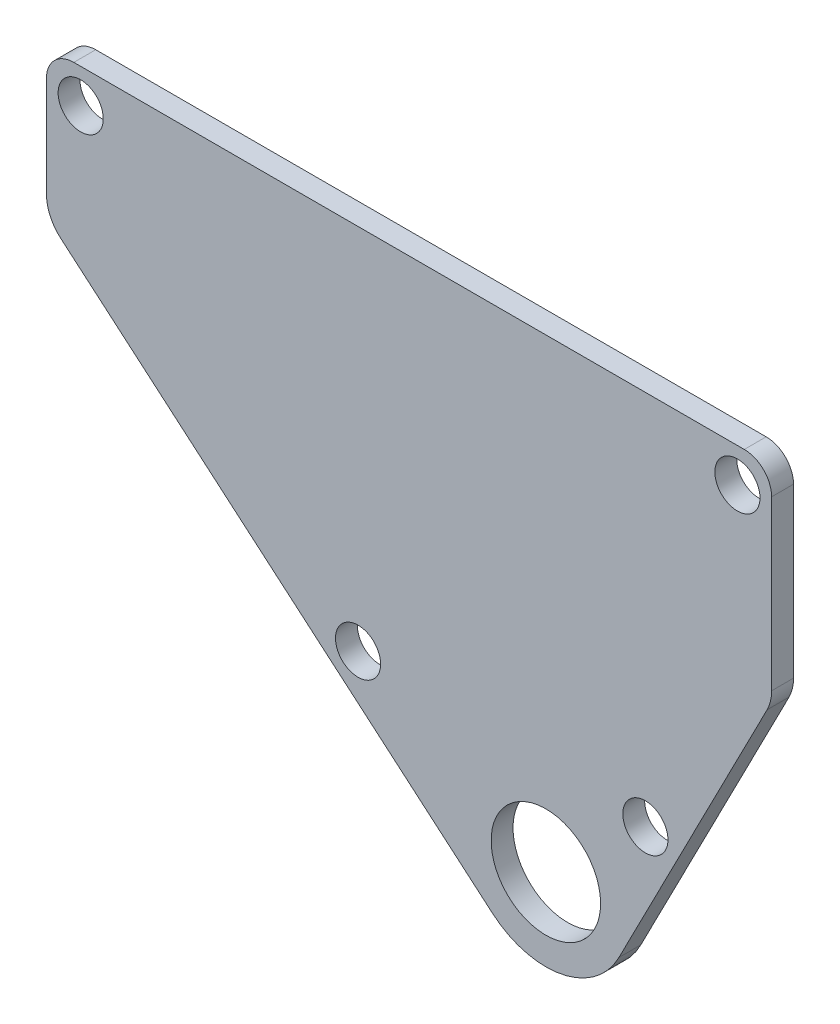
ISO-10303-21;
HEADER;
FILE_DESCRIPTION(('STEP AP214'),'2;1');
FILE_NAME('part.step','',(''),(''),'','','');
FILE_SCHEMA(('AUTOMOTIVE_DESIGN { 1 0 10303 214 1 1 1 1 }'));
ENDSEC;
DATA;
#1=APPLICATION_CONTEXT('core data for automotive mechanical design processes');
#2=APPLICATION_PROTOCOL_DEFINITION('international standard','automotive_design',2000,#1);
#3=PRODUCT_CONTEXT('',#1,'mechanical');
#4=PRODUCT('Part','Part','',(#3));
#5=PRODUCT_RELATED_PRODUCT_CATEGORY('part','',(#4));
#6=PRODUCT_DEFINITION_FORMATION('','',#4);
#7=PRODUCT_DEFINITION_CONTEXT('part definition',#1,'design');
#8=PRODUCT_DEFINITION('design','',#6,#7);
#9=PRODUCT_DEFINITION_SHAPE('','',#8);
#10=(LENGTH_UNIT() NAMED_UNIT(*) SI_UNIT(.MILLI.,.METRE.));
#11=(NAMED_UNIT(*) PLANE_ANGLE_UNIT() SI_UNIT($,.RADIAN.));
#12=(NAMED_UNIT(*) SI_UNIT($,.STERADIAN.) SOLID_ANGLE_UNIT());
#13=UNCERTAINTY_MEASURE_WITH_UNIT(LENGTH_MEASURE(1.E-05),#10,'distance_accuracy_value','');
#14=(GEOMETRIC_REPRESENTATION_CONTEXT(3) GLOBAL_UNCERTAINTY_ASSIGNED_CONTEXT((#13)) GLOBAL_UNIT_ASSIGNED_CONTEXT((#10,
#11,#12)) REPRESENTATION_CONTEXT('',''));
#15=CARTESIAN_POINT('',(0.,0.,0.));
#16=DIRECTION('',(0.,0.,1.));
#17=DIRECTION('',(1.,0.,0.));
#18=AXIS2_PLACEMENT_3D('',#15,#16,#17);
#19=CARTESIAN_POINT('',(-40.,-40.,1.6));
#20=DIRECTION('',(0.,0.,-1.));
#21=DIRECTION('',(-1.,0.,0.));
#22=AXIS2_PLACEMENT_3D('',#19,#20,#21);
#23=PLANE('',#22);
#24=CARTESIAN_POINT('',(23.4995807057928,5.99918336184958,1.6));
#25=DIRECTION('',(0.,0.,1.));
#26=DIRECTION('',(1.,0.,0.));
#27=AXIS2_PLACEMENT_3D('',#24,#25,#26);
#28=CIRCLE('',#27,6.);
#29=CARTESIAN_POINT('',(28.8371435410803,3.25866826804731,1.6));
#30=VERTEX_POINT('',#29);
#31=CARTESIAN_POINT('',(19.6038678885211,1.43591461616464,1.6));
#32=VERTEX_POINT('',#31);
#33=EDGE_CURVE('E103',#30,#32,#28,.F.);
#34=ORIENTED_EDGE('',*,*,#33,.F.);
#35=DIRECTION('',(0.456752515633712,0.889593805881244,0.));
#36=VECTOR('',#35,1.);
#37=CARTESIAN_POINT('',(40.,25.,1.6));
#38=LINE('',#37,#36);
#39=CARTESIAN_POINT('',(39.6687814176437,24.3549022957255,1.6));
#40=VERTEX_POINT('',#39);
#41=EDGE_CURVE('E100',#40,#30,#38,.F.);
#42=ORIENTED_EDGE('',*,*,#41,.F.);
#43=CARTESIAN_POINT('',(37.,25.7251598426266,1.6));
#44=DIRECTION('',(0.,0.,-1.));
#45=DIRECTION('',(-1.,0.,0.));
#46=AXIS2_PLACEMENT_3D('',#43,#44,#45);
#47=CIRCLE('',#46,3.);
#48=CARTESIAN_POINT('',(40.,25.7251598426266,1.6));
#49=VERTEX_POINT('',#48);
#50=EDGE_CURVE('E20',#49,#40,#47,.T.);
#51=ORIENTED_EDGE('',*,*,#50,.F.);
#52=DIRECTION('',(0.,-1.,0.));
#53=VECTOR('',#52,1.);
#54=CARTESIAN_POINT('',(40.,40.,1.6));
#55=LINE('',#54,#53);
#56=CARTESIAN_POINT('',(40.,38.,1.6));
#57=VERTEX_POINT('',#56);
#58=EDGE_CURVE('E117',#49,#57,#55,.F.);
#59=ORIENTED_EDGE('',*,*,#58,.T.);
#60=CARTESIAN_POINT('',(38.,38.,1.6));
#61=DIRECTION('',(0.,0.,-1.));
#62=DIRECTION('',(-1.,0.,0.));
#63=AXIS2_PLACEMENT_3D('',#60,#61,#62);
#64=CIRCLE('',#63,2.);
#65=CARTESIAN_POINT('',(38.,40.,1.6));
#66=VERTEX_POINT('',#65);
#67=EDGE_CURVE('E127',#66,#57,#64,.T.);
#68=ORIENTED_EDGE('',*,*,#67,.F.);
#69=DIRECTION('',(1.,0.,0.));
#70=VECTOR('',#69,1.);
#71=CARTESIAN_POINT('',(40.,40.,1.6));
#72=LINE('',#71,#70);
#73=CARTESIAN_POINT('',(-11.,40.,1.6));
#74=VERTEX_POINT('',#73);
#75=EDGE_CURVE('E130',#66,#74,#72,.F.);
#76=ORIENTED_EDGE('',*,*,#75,.T.);
#77=CARTESIAN_POINT('',(-11.,38.,1.6));
#78=DIRECTION('',(0.,0.,-1.));
#79=DIRECTION('',(-1.,0.,0.));
#80=AXIS2_PLACEMENT_3D('',#77,#78,#79);
#81=CIRCLE('',#80,2.);
#82=CARTESIAN_POINT('',(-13.,38.,1.6));
#83=VERTEX_POINT('',#82);
#84=EDGE_CURVE('E131',#83,#74,#81,.T.);
#85=ORIENTED_EDGE('',*,*,#84,.F.);
#86=DIRECTION('',(0.,1.,0.));
#87=VECTOR('',#86,1.);
#88=CARTESIAN_POINT('',(-13.,40.,1.6));
#89=LINE('',#88,#87);
#90=CARTESIAN_POINT('',(-13.,30.6536037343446,1.6));
#91=VERTEX_POINT('',#90);
#92=EDGE_CURVE('E135',#91,#83,#89,.T.);
#93=ORIENTED_EDGE('',*,*,#92,.F.);
#94=CARTESIAN_POINT('',(-10.,30.6536037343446,1.6));
#95=DIRECTION('',(0.,0.,1.));
#96=DIRECTION('',(1.,0.,0.));
#97=AXIS2_PLACEMENT_3D('',#94,#95,#96);
#98=CIRCLE('',#97,3.);
#99=CARTESIAN_POINT('',(-11.9478564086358,28.3719693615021,1.6));
#100=VERTEX_POINT('',#99);
#101=EDGE_CURVE('E139',#100,#91,#98,.F.);
#102=ORIENTED_EDGE('',*,*,#101,.F.);
#103=DIRECTION('',(0.760544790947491,-0.649285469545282,0.));
#104=VECTOR('',#103,1.);
#105=CARTESIAN_POINT('',(8.9735043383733,10.5111731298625,1.6));
#106=LINE('',#105,#104);
#107=EDGE_CURVE('E143',#32,#100,#106,.F.);
#108=ORIENTED_EDGE('',*,*,#107,.F.);
#109=EDGE_LOOP('',(#34,#42,#51,#59,#68,#76,#85,#93,#102,#108));
#110=FACE_BOUND('',#109,.T.);
#111=CARTESIAN_POINT('',(23.5,6.,1.6));
#112=DIRECTION('',(0.,0.,1.));
#113=DIRECTION('',(1.,0.,0.));
#114=AXIS2_PLACEMENT_3D('',#111,#112,#113);
#115=CIRCLE('',#114,4.);
#116=CARTESIAN_POINT('',(27.5,6.,1.6));
#117=VERTEX_POINT('',#116);
#118=EDGE_CURVE('E107',#117,#117,#115,.F.);
#119=ORIENTED_EDGE('',*,*,#118,.T.);
#120=EDGE_LOOP('',(#119));
#121=FACE_BOUND('',#120,.T.);
#122=CARTESIAN_POINT('',(-10.5000008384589,37.5000001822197,1.6));
#123=DIRECTION('',(0.,0.,1.));
#124=DIRECTION('',(1.,0.,0.));
#125=AXIS2_PLACEMENT_3D('',#122,#123,#124);
#126=CIRCLE('',#125,1.65);
#127=CARTESIAN_POINT('',(-8.85000083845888,37.5000001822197,1.6));
#128=VERTEX_POINT('',#127);
#129=EDGE_CURVE('E185',#128,#128,#126,.F.);
#130=ORIENTED_EDGE('',*,*,#129,.T.);
#131=EDGE_LOOP('',(#130));
#132=FACE_BOUND('',#131,.T.);
#133=CARTESIAN_POINT('',(37.5000281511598,37.4999997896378,1.6));
#134=DIRECTION('',(0.,0.,1.));
#135=DIRECTION('',(1.,0.,0.));
#136=AXIS2_PLACEMENT_3D('',#133,#134,#135);
#137=CIRCLE('',#136,1.64999999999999);
#138=CARTESIAN_POINT('',(39.1500281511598,37.4999997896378,1.6));
#139=VERTEX_POINT('',#138);
#140=EDGE_CURVE('E188',#139,#139,#137,.F.);
#141=ORIENTED_EDGE('',*,*,#140,.T.);
#142=EDGE_LOOP('',(#141));
#143=FACE_BOUND('',#142,.T.);
#144=CARTESIAN_POINT('',(30.77175874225,12.499986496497,1.6));
#145=DIRECTION('',(0.,0.,1.));
#146=DIRECTION('',(1.,0.,0.));
#147=AXIS2_PLACEMENT_3D('',#144,#145,#146);
#148=CIRCLE('',#147,1.65);
#149=CARTESIAN_POINT('',(32.42175874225,12.499986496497,1.6));
#150=VERTEX_POINT('',#149);
#151=EDGE_CURVE('E191',#150,#150,#148,.F.);
#152=ORIENTED_EDGE('',*,*,#151,.T.);
#153=EDGE_LOOP('',(#152));
#154=FACE_BOUND('',#153,.T.);
#155=CARTESIAN_POINT('',(9.77175874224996,13.1168119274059,1.6));
#156=DIRECTION('',(0.,0.,1.));
#157=DIRECTION('',(1.,0.,0.));
#158=AXIS2_PLACEMENT_3D('',#155,#156,#157);
#159=CIRCLE('',#158,1.65);
#160=CARTESIAN_POINT('',(11.42175874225,13.1168119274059,1.6));
#161=VERTEX_POINT('',#160);
#162=EDGE_CURVE('E98',#161,#161,#159,.F.);
#163=ORIENTED_EDGE('',*,*,#162,.T.);
#164=EDGE_LOOP('',(#163));
#165=FACE_BOUND('',#164,.T.);
#166=ADVANCED_FACE('F17',(#110,#121,#132,#143,#154,#165),#23,.F.);
#167=CARTESIAN_POINT('',(9.77175874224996,13.1168119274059,0.));
#168=DIRECTION('',(0.,0.,1.));
#169=DIRECTION('',(1.,0.,0.));
#170=AXIS2_PLACEMENT_3D('',#167,#168,#169);
#171=CYLINDRICAL_SURFACE('',#170,1.65);
#172=ORIENTED_EDGE('',*,*,#162,.F.);
#173=EDGE_LOOP('',(#172));
#174=FACE_BOUND('',#173,.T.);
#175=CARTESIAN_POINT('',(9.77175874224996,13.1168119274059,0.));
#176=DIRECTION('',(0.,0.,1.));
#177=DIRECTION('',(1.,0.,0.));
#178=AXIS2_PLACEMENT_3D('',#175,#176,#177);
#179=CIRCLE('',#178,1.65);
#180=CARTESIAN_POINT('',(11.42175874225,13.1168119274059,0.));
#181=VERTEX_POINT('',#180);
#182=EDGE_CURVE('E112',#181,#181,#179,.T.);
#183=ORIENTED_EDGE('',*,*,#182,.F.);
#184=EDGE_LOOP('',(#183));
#185=FACE_BOUND('',#184,.T.);
#186=ADVANCED_FACE('F197',(#174,#185),#171,.F.);
#187=CARTESIAN_POINT('',(30.77175874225,12.499986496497,0.));
#188=DIRECTION('',(0.,0.,1.));
#189=DIRECTION('',(1.,0.,0.));
#190=AXIS2_PLACEMENT_3D('',#187,#188,#189);
#191=CYLINDRICAL_SURFACE('',#190,1.65);
#192=ORIENTED_EDGE('',*,*,#151,.F.);
#193=EDGE_LOOP('',(#192));
#194=FACE_BOUND('',#193,.T.);
#195=CARTESIAN_POINT('',(30.77175874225,12.499986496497,0.));
#196=DIRECTION('',(0.,0.,1.));
#197=DIRECTION('',(1.,0.,0.));
#198=AXIS2_PLACEMENT_3D('',#195,#196,#197);
#199=CIRCLE('',#198,1.65);
#200=CARTESIAN_POINT('',(32.42175874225,12.499986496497,0.));
#201=VERTEX_POINT('',#200);
#202=EDGE_CURVE('E115',#201,#201,#199,.T.);
#203=ORIENTED_EDGE('',*,*,#202,.F.);
#204=EDGE_LOOP('',(#203));
#205=FACE_BOUND('',#204,.T.);
#206=ADVANCED_FACE('F200',(#194,#205),#191,.F.);
#207=CARTESIAN_POINT('',(37.5000281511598,37.4999997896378,0.));
#208=DIRECTION('',(0.,0.,1.));
#209=DIRECTION('',(1.,0.,0.));
#210=AXIS2_PLACEMENT_3D('',#207,#208,#209);
#211=CYLINDRICAL_SURFACE('',#210,1.64999999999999);
#212=ORIENTED_EDGE('',*,*,#140,.F.);
#213=EDGE_LOOP('',(#212));
#214=FACE_BOUND('',#213,.T.);
#215=CARTESIAN_POINT('',(37.5000281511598,37.4999997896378,0.));
#216=DIRECTION('',(0.,0.,1.));
#217=DIRECTION('',(1.,0.,0.));
#218=AXIS2_PLACEMENT_3D('',#215,#216,#217);
#219=CIRCLE('',#218,1.64999999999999);
#220=CARTESIAN_POINT('',(39.1500281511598,37.4999997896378,0.));
#221=VERTEX_POINT('',#220);
#222=EDGE_CURVE('E174',#221,#221,#219,.T.);
#223=ORIENTED_EDGE('',*,*,#222,.F.);
#224=EDGE_LOOP('',(#223));
#225=FACE_BOUND('',#224,.T.);
#226=ADVANCED_FACE('F255',(#214,#225),#211,.F.);
#227=CARTESIAN_POINT('',(-10.5000008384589,37.5000001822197,0.));
#228=DIRECTION('',(0.,0.,1.));
#229=DIRECTION('',(1.,0.,0.));
#230=AXIS2_PLACEMENT_3D('',#227,#228,#229);
#231=CYLINDRICAL_SURFACE('',#230,1.65);
#232=ORIENTED_EDGE('',*,*,#129,.F.);
#233=EDGE_LOOP('',(#232));
#234=FACE_BOUND('',#233,.T.);
#235=CARTESIAN_POINT('',(-10.5000008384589,37.5000001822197,0.));
#236=DIRECTION('',(0.,0.,1.));
#237=DIRECTION('',(1.,0.,0.));
#238=AXIS2_PLACEMENT_3D('',#235,#236,#237);
#239=CIRCLE('',#238,1.65);
#240=CARTESIAN_POINT('',(-8.85000083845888,37.5000001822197,0.));
#241=VERTEX_POINT('',#240);
#242=EDGE_CURVE('E171',#241,#241,#239,.T.);
#243=ORIENTED_EDGE('',*,*,#242,.F.);
#244=EDGE_LOOP('',(#243));
#245=FACE_BOUND('',#244,.T.);
#246=ADVANCED_FACE('F251',(#234,#245),#231,.F.);
#247=CARTESIAN_POINT('',(23.5,6.,0.));
#248=DIRECTION('',(0.,0.,1.));
#249=DIRECTION('',(1.,0.,0.));
#250=AXIS2_PLACEMENT_3D('',#247,#248,#249);
#251=CYLINDRICAL_SURFACE('',#250,4.);
#252=ORIENTED_EDGE('',*,*,#118,.F.);
#253=EDGE_LOOP('',(#252));
#254=FACE_BOUND('',#253,.T.);
#255=CARTESIAN_POINT('',(23.5,6.,0.));
#256=DIRECTION('',(0.,0.,1.));
#257=DIRECTION('',(1.,0.,0.));
#258=AXIS2_PLACEMENT_3D('',#255,#256,#257);
#259=CIRCLE('',#258,4.);
#260=CARTESIAN_POINT('',(27.5,6.,0.));
#261=VERTEX_POINT('',#260);
#262=EDGE_CURVE('E168',#261,#261,#259,.T.);
#263=ORIENTED_EDGE('',*,*,#262,.F.);
#264=EDGE_LOOP('',(#263));
#265=FACE_BOUND('',#264,.T.);
#266=ADVANCED_FACE('F248',(#254,#265),#251,.F.);
#267=CARTESIAN_POINT('',(40.,25.,0.));
#268=DIRECTION('',(0.889593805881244,-0.456752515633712,0.));
#269=DIRECTION('',(0.456752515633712,0.889593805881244,0.));
#270=AXIS2_PLACEMENT_3D('',#267,#268,#269);
#271=PLANE('',#270);
#272=DIRECTION('',(-0.456752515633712,-0.889593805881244,0.));
#273=VECTOR('',#272,1.);
#274=CARTESIAN_POINT('',(39.6687814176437,24.3549022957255,0.));
#275=LINE('',#274,#273);
#276=CARTESIAN_POINT('',(39.6687814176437,24.3549022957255,0.));
#277=VERTEX_POINT('',#276);
#278=CARTESIAN_POINT('',(28.8371435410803,3.25866826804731,0.));
#279=VERTEX_POINT('',#278);
#280=EDGE_CURVE('E111',#277,#279,#275,.T.);
#281=ORIENTED_EDGE('',*,*,#280,.F.);
#282=DIRECTION('',(0.,0.,-1.));
#283=VECTOR('',#282,1.);
#284=CARTESIAN_POINT('',(39.6687814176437,24.3549022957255,0.));
#285=LINE('',#284,#283);
#286=EDGE_CURVE('E97',#40,#277,#285,.T.);
#287=ORIENTED_EDGE('',*,*,#286,.F.);
#288=ORIENTED_EDGE('',*,*,#41,.T.);
#289=DIRECTION('',(0.,0.,1.));
#290=VECTOR('',#289,1.);
#291=CARTESIAN_POINT('',(28.8371435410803,3.25866826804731,-8.4));
#292=LINE('',#291,#290);
#293=EDGE_CURVE('E106',#279,#30,#292,.T.);
#294=ORIENTED_EDGE('',*,*,#293,.F.);
#295=EDGE_LOOP('',(#281,#287,#288,#294));
#296=FACE_BOUND('',#295,.T.);
#297=ADVANCED_FACE('F109',(#296),#271,.T.);
#298=CARTESIAN_POINT('',(23.4995807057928,5.99918336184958,-8.4));
#299=DIRECTION('',(0.,0.,1.));
#300=DIRECTION('',(1.,0.,0.));
#301=AXIS2_PLACEMENT_3D('',#298,#299,#300);
#302=CYLINDRICAL_SURFACE('',#301,6.);
#303=ORIENTED_EDGE('',*,*,#33,.T.);
#304=DIRECTION('',(0.,0.,1.));
#305=VECTOR('',#304,1.);
#306=CARTESIAN_POINT('',(19.6038678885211,1.43591461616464,-8.4));
#307=LINE('',#306,#305);
#308=CARTESIAN_POINT('',(19.6038678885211,1.43591461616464,0.));
#309=VERTEX_POINT('',#308);
#310=EDGE_CURVE('E144',#309,#32,#307,.T.);
#311=ORIENTED_EDGE('',*,*,#310,.F.);
#312=CARTESIAN_POINT('',(23.4995807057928,5.99918336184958,0.));
#313=DIRECTION('',(0.,0.,1.));
#314=DIRECTION('',(1.,0.,0.));
#315=AXIS2_PLACEMENT_3D('',#312,#313,#314);
#316=CIRCLE('',#315,6.);
#317=EDGE_CURVE('E165',#279,#309,#316,.F.);
#318=ORIENTED_EDGE('',*,*,#317,.F.);
#319=ORIENTED_EDGE('',*,*,#293,.T.);
#320=EDGE_LOOP('',(#303,#311,#318,#319));
#321=FACE_BOUND('',#320,.T.);
#322=ADVANCED_FACE('F241',(#321),#302,.T.);
#323=CARTESIAN_POINT('',(8.9735043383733,10.5111731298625,-8.4));
#324=DIRECTION('',(-0.649285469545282,-0.760544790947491,0.));
#325=DIRECTION('',(0.760544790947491,-0.649285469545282,0.));
#326=AXIS2_PLACEMENT_3D('',#323,#324,#325);
#327=PLANE('',#326);
#328=ORIENTED_EDGE('',*,*,#107,.T.);
#329=DIRECTION('',(0.,0.,1.));
#330=VECTOR('',#329,1.);
#331=CARTESIAN_POINT('',(-11.9478564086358,28.3719693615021,0.));
#332=LINE('',#331,#330);
#333=CARTESIAN_POINT('',(-11.9478564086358,28.3719693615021,0.));
#334=VERTEX_POINT('',#333);
#335=EDGE_CURVE('E140',#334,#100,#332,.T.);
#336=ORIENTED_EDGE('',*,*,#335,.F.);
#337=DIRECTION('',(-0.760544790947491,0.649285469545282,0.));
#338=VECTOR('',#337,1.);
#339=CARTESIAN_POINT('',(19.6038678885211,1.43591461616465,0.));
#340=LINE('',#339,#338);
#341=EDGE_CURVE('E164',#309,#334,#340,.T.);
#342=ORIENTED_EDGE('',*,*,#341,.F.);
#343=ORIENTED_EDGE('',*,*,#310,.T.);
#344=EDGE_LOOP('',(#328,#336,#342,#343));
#345=FACE_BOUND('',#344,.T.);
#346=ADVANCED_FACE('F237',(#345),#327,.T.);
#347=CARTESIAN_POINT('',(-10.,30.6536037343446,0.));
#348=DIRECTION('',(0.,0.,1.));
#349=DIRECTION('',(1.,0.,0.));
#350=AXIS2_PLACEMENT_3D('',#347,#348,#349);
#351=CYLINDRICAL_SURFACE('',#350,3.);
#352=ORIENTED_EDGE('',*,*,#101,.T.);
#353=DIRECTION('',(0.,0.,1.));
#354=VECTOR('',#353,1.);
#355=CARTESIAN_POINT('',(-13.,30.6536037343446,0.));
#356=LINE('',#355,#354);
#357=CARTESIAN_POINT('',(-13.,30.6536037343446,0.));
#358=VERTEX_POINT('',#357);
#359=EDGE_CURVE('E136',#358,#91,#356,.T.);
#360=ORIENTED_EDGE('',*,*,#359,.F.);
#361=CARTESIAN_POINT('',(-10.,30.6536037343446,0.));
#362=DIRECTION('',(0.,0.,1.));
#363=DIRECTION('',(1.,0.,0.));
#364=AXIS2_PLACEMENT_3D('',#361,#362,#363);
#365=CIRCLE('',#364,3.);
#366=EDGE_CURVE('E161',#334,#358,#365,.F.);
#367=ORIENTED_EDGE('',*,*,#366,.F.);
#368=ORIENTED_EDGE('',*,*,#335,.T.);
#369=EDGE_LOOP('',(#352,#360,#367,#368));
#370=FACE_BOUND('',#369,.T.);
#371=ADVANCED_FACE('F233',(#370),#351,.T.);
#372=CARTESIAN_POINT('',(-13.,40.,0.));
#373=DIRECTION('',(-1.,0.,0.));
#374=DIRECTION('',(0.,0.,1.));
#375=AXIS2_PLACEMENT_3D('',#372,#373,#374);
#376=PLANE('',#375);
#377=ORIENTED_EDGE('',*,*,#92,.T.);
#378=DIRECTION('',(0.,0.,-1.));
#379=VECTOR('',#378,1.);
#380=CARTESIAN_POINT('',(-13.,38.,1.6));
#381=LINE('',#380,#379);
#382=CARTESIAN_POINT('',(-13.,38.,0.));
#383=VERTEX_POINT('',#382);
#384=EDGE_CURVE('E132',#383,#83,#381,.F.);
#385=ORIENTED_EDGE('',*,*,#384,.F.);
#386=DIRECTION('',(0.,1.,0.));
#387=VECTOR('',#386,1.);
#388=CARTESIAN_POINT('',(-13.,-40.,0.));
#389=LINE('',#388,#387);
#390=EDGE_CURVE('E160',#358,#383,#389,.T.);
#391=ORIENTED_EDGE('',*,*,#390,.F.);
#392=ORIENTED_EDGE('',*,*,#359,.T.);
#393=EDGE_LOOP('',(#377,#385,#391,#392));
#394=FACE_BOUND('',#393,.T.);
#395=ADVANCED_FACE('F229',(#394),#376,.T.);
#396=CARTESIAN_POINT('',(-11.,38.,1.6));
#397=DIRECTION('',(0.,0.,-1.));
#398=DIRECTION('',(-1.,0.,0.));
#399=AXIS2_PLACEMENT_3D('',#396,#397,#398);
#400=CYLINDRICAL_SURFACE('',#399,2.);
#401=ORIENTED_EDGE('',*,*,#84,.T.);
#402=DIRECTION('',(0.,0.,1.));
#403=VECTOR('',#402,1.);
#404=CARTESIAN_POINT('',(-11.,40.,1.6));
#405=LINE('',#404,#403);
#406=CARTESIAN_POINT('',(-11.,40.,0.));
#407=VERTEX_POINT('',#406);
#408=EDGE_CURVE('E128',#74,#407,#405,.F.);
#409=ORIENTED_EDGE('',*,*,#408,.T.);
#410=CARTESIAN_POINT('',(-11.,38.,0.));
#411=DIRECTION('',(0.,0.,-1.));
#412=DIRECTION('',(-1.,0.,0.));
#413=AXIS2_PLACEMENT_3D('',#410,#411,#412);
#414=CIRCLE('',#413,2.);
#415=EDGE_CURVE('E157',#383,#407,#414,.T.);
#416=ORIENTED_EDGE('',*,*,#415,.F.);
#417=ORIENTED_EDGE('',*,*,#384,.T.);
#418=EDGE_LOOP('',(#401,#409,#416,#417));
#419=FACE_BOUND('',#418,.T.);
#420=ADVANCED_FACE('F225',(#419),#400,.T.);
#421=CARTESIAN_POINT('',(40.,40.,1.6));
#422=DIRECTION('',(0.,-1.,0.));
#423=DIRECTION('',(1.,0.,0.));
#424=AXIS2_PLACEMENT_3D('',#421,#422,#423);
#425=PLANE('',#424);
#426=DIRECTION('',(0.,0.,-1.));
#427=VECTOR('',#426,1.);
#428=CARTESIAN_POINT('',(38.,40.,1.6));
#429=LINE('',#428,#427);
#430=CARTESIAN_POINT('',(38.,40.,0.));
#431=VERTEX_POINT('',#430);
#432=EDGE_CURVE('E124',#431,#66,#429,.F.);
#433=ORIENTED_EDGE('',*,*,#432,.F.);
#434=DIRECTION('',(-1.,0.,0.));
#435=VECTOR('',#434,1.);
#436=CARTESIAN_POINT('',(-40.,40.,0.));
#437=LINE('',#436,#435);
#438=EDGE_CURVE('E156',#407,#431,#437,.F.);
#439=ORIENTED_EDGE('',*,*,#438,.F.);
#440=ORIENTED_EDGE('',*,*,#408,.F.);
#441=ORIENTED_EDGE('',*,*,#75,.F.);
#442=EDGE_LOOP('',(#433,#439,#440,#441));
#443=FACE_BOUND('',#442,.T.);
#444=ADVANCED_FACE('F221',(#443),#425,.F.);
#445=CARTESIAN_POINT('',(38.,38.,1.6));
#446=DIRECTION('',(0.,0.,-1.));
#447=DIRECTION('',(-1.,0.,0.));
#448=AXIS2_PLACEMENT_3D('',#445,#446,#447);
#449=CYLINDRICAL_SURFACE('',#448,2.);
#450=CARTESIAN_POINT('',(38.,38.,0.));
#451=DIRECTION('',(0.,0.,-1.));
#452=DIRECTION('',(-1.,0.,0.));
#453=AXIS2_PLACEMENT_3D('',#450,#451,#452);
#454=CIRCLE('',#453,2.);
#455=CARTESIAN_POINT('',(40.,38.,0.));
#456=VERTEX_POINT('',#455);
#457=EDGE_CURVE('E153',#431,#456,#454,.T.);
#458=ORIENTED_EDGE('',*,*,#457,.F.);
#459=ORIENTED_EDGE('',*,*,#432,.T.);
#460=ORIENTED_EDGE('',*,*,#67,.T.);
#461=DIRECTION('',(0.,0.,1.));
#462=VECTOR('',#461,1.);
#463=CARTESIAN_POINT('',(40.,38.,1.6));
#464=LINE('',#463,#462);
#465=EDGE_CURVE('E122',#57,#456,#464,.F.);
#466=ORIENTED_EDGE('',*,*,#465,.T.);
#467=EDGE_LOOP('',(#458,#459,#460,#466));
#468=FACE_BOUND('',#467,.T.);
#469=ADVANCED_FACE('F218',(#468),#449,.T.);
#470=CARTESIAN_POINT('',(40.,40.,1.6));
#471=DIRECTION('',(-1.,0.,0.));
#472=DIRECTION('',(0.,-1.,0.));
#473=AXIS2_PLACEMENT_3D('',#470,#471,#472);
#474=PLANE('',#473);
#475=DIRECTION('',(0.,0.,-1.));
#476=VECTOR('',#475,1.);
#477=CARTESIAN_POINT('',(40.,25.7251598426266,0.));
#478=LINE('',#477,#476);
#479=CARTESIAN_POINT('',(40.,25.7251598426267,0.));
#480=VERTEX_POINT('',#479);
#481=EDGE_CURVE('E35',#480,#49,#478,.F.);
#482=ORIENTED_EDGE('',*,*,#481,.F.);
#483=DIRECTION('',(0.,1.,0.));
#484=VECTOR('',#483,1.);
#485=CARTESIAN_POINT('',(40.,-40.,0.));
#486=LINE('',#485,#484);
#487=EDGE_CURVE('E26',#456,#480,#486,.F.);
#488=ORIENTED_EDGE('',*,*,#487,.F.);
#489=ORIENTED_EDGE('',*,*,#465,.F.);
#490=ORIENTED_EDGE('',*,*,#58,.F.);
#491=EDGE_LOOP('',(#482,#488,#489,#490));
#492=FACE_BOUND('',#491,.T.);
#493=ADVANCED_FACE('F211',(#492),#474,.F.);
#494=CARTESIAN_POINT('',(37.,25.7251598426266,0.));
#495=DIRECTION('',(0.,0.,-1.));
#496=DIRECTION('',(-1.,0.,0.));
#497=AXIS2_PLACEMENT_3D('',#494,#495,#496);
#498=CYLINDRICAL_SURFACE('',#497,3.);
#499=ORIENTED_EDGE('',*,*,#50,.T.);
#500=ORIENTED_EDGE('',*,*,#286,.T.);
#501=CARTESIAN_POINT('',(37.,25.7251598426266,0.));
#502=DIRECTION('',(0.,0.,-1.));
#503=DIRECTION('',(-1.,0.,0.));
#504=AXIS2_PLACEMENT_3D('',#501,#502,#503);
#505=CIRCLE('',#504,3.);
#506=EDGE_CURVE('E11',#480,#277,#505,.T.);
#507=ORIENTED_EDGE('',*,*,#506,.F.);
#508=ORIENTED_EDGE('',*,*,#481,.T.);
#509=EDGE_LOOP('',(#499,#500,#507,#508));
#510=FACE_BOUND('',#509,.T.);
#511=ADVANCED_FACE('F95',(#510),#498,.T.);
#512=CARTESIAN_POINT('',(-40.,-40.,0.));
#513=DIRECTION('',(0.,0.,-1.));
#514=DIRECTION('',(-1.,0.,0.));
#515=AXIS2_PLACEMENT_3D('',#512,#513,#514);
#516=PLANE('',#515);
#517=ORIENTED_EDGE('',*,*,#487,.T.);
#518=ORIENTED_EDGE('',*,*,#506,.T.);
#519=ORIENTED_EDGE('',*,*,#280,.T.);
#520=ORIENTED_EDGE('',*,*,#317,.T.);
#521=ORIENTED_EDGE('',*,*,#341,.T.);
#522=ORIENTED_EDGE('',*,*,#366,.T.);
#523=ORIENTED_EDGE('',*,*,#390,.T.);
#524=ORIENTED_EDGE('',*,*,#415,.T.);
#525=ORIENTED_EDGE('',*,*,#438,.T.);
#526=ORIENTED_EDGE('',*,*,#457,.T.);
#527=EDGE_LOOP('',(#517,#518,#519,#520,#521,#522,#523,#524,#525,#526));
#528=FACE_BOUND('',#527,.T.);
#529=ORIENTED_EDGE('',*,*,#262,.T.);
#530=EDGE_LOOP('',(#529));
#531=FACE_BOUND('',#530,.T.);
#532=ORIENTED_EDGE('',*,*,#242,.T.);
#533=EDGE_LOOP('',(#532));
#534=FACE_BOUND('',#533,.T.);
#535=ORIENTED_EDGE('',*,*,#222,.T.);
#536=EDGE_LOOP('',(#535));
#537=FACE_BOUND('',#536,.T.);
#538=ORIENTED_EDGE('',*,*,#202,.T.);
#539=EDGE_LOOP('',(#538));
#540=FACE_BOUND('',#539,.T.);
#541=ORIENTED_EDGE('',*,*,#182,.T.);
#542=EDGE_LOOP('',(#541));
#543=FACE_BOUND('',#542,.T.);
#544=ADVANCED_FACE('F203',(#528,#531,#534,#537,#540,#543),#516,.T.);
#545=CLOSED_SHELL('',(#166,#186,#206,#226,#246,#266,#297,#322,#346,#371,#395,#420,#444,#469,
#493,#511,#544));
#546=MANIFOLD_SOLID_BREP('B1',#545);
#547=ADVANCED_BREP_SHAPE_REPRESENTATION('',(#18,#546),#14);
#548=SHAPE_DEFINITION_REPRESENTATION(#9,#547);
ENDSEC;
END-ISO-10303-21;
